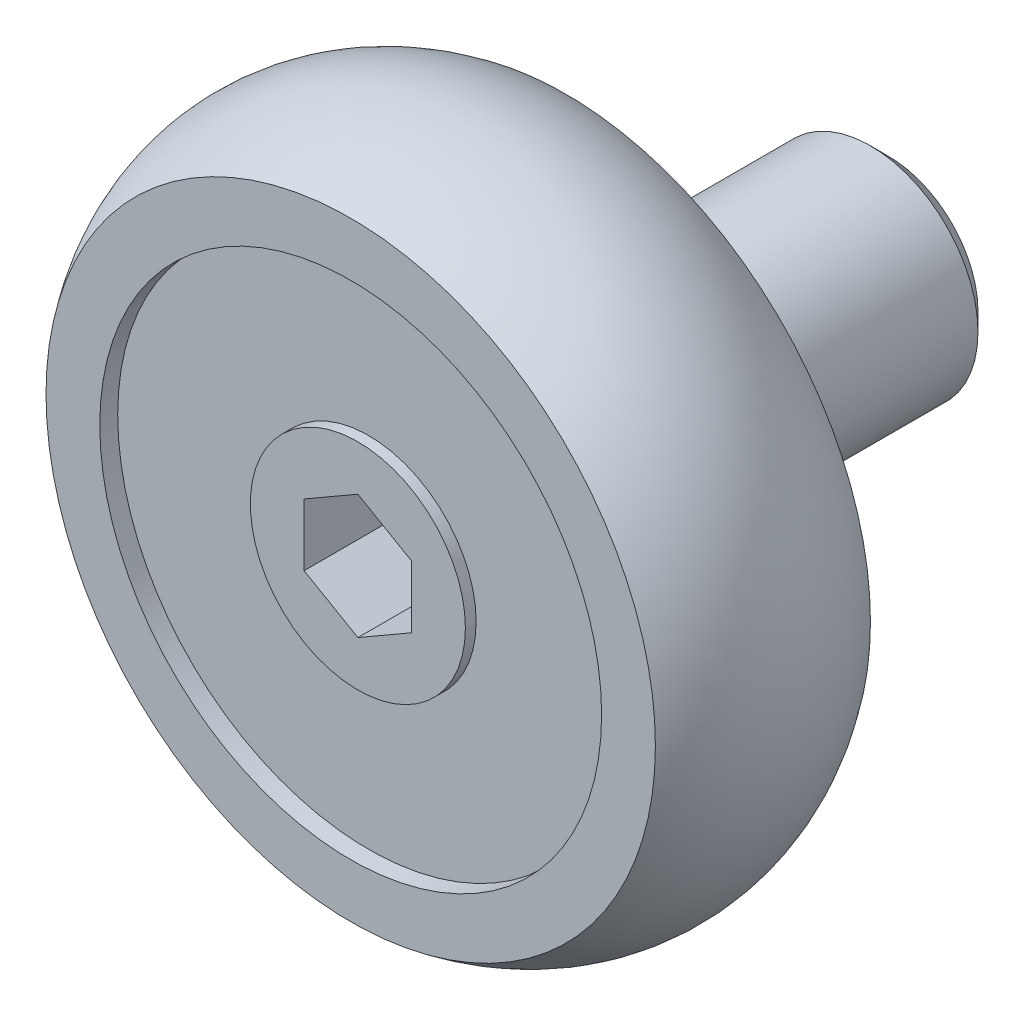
ISO-10303-21;
HEADER;
FILE_DESCRIPTION(('STEP AP214'),'2;1');
FILE_NAME('part.step','',(''),(''),'','','');
FILE_SCHEMA(('AUTOMOTIVE_DESIGN { 1 0 10303 214 1 1 1 1 }'));
ENDSEC;
DATA;
#1=APPLICATION_CONTEXT('core data for automotive mechanical design processes');
#2=APPLICATION_PROTOCOL_DEFINITION('international standard','automotive_design',2000,#1);
#3=PRODUCT_CONTEXT('',#1,'mechanical');
#4=PRODUCT('Part','Part','',(#3));
#5=PRODUCT_RELATED_PRODUCT_CATEGORY('part','',(#4));
#6=PRODUCT_DEFINITION_FORMATION('','',#4);
#7=PRODUCT_DEFINITION_CONTEXT('part definition',#1,'design');
#8=PRODUCT_DEFINITION('design','',#6,#7);
#9=PRODUCT_DEFINITION_SHAPE('','',#8);
#10=(LENGTH_UNIT() NAMED_UNIT(*) SI_UNIT(.MILLI.,.METRE.));
#11=(NAMED_UNIT(*) PLANE_ANGLE_UNIT() SI_UNIT($,.RADIAN.));
#12=(NAMED_UNIT(*) SI_UNIT($,.STERADIAN.) SOLID_ANGLE_UNIT());
#13=UNCERTAINTY_MEASURE_WITH_UNIT(LENGTH_MEASURE(1.E-05),#10,'distance_accuracy_value','');
#14=(GEOMETRIC_REPRESENTATION_CONTEXT(3) GLOBAL_UNCERTAINTY_ASSIGNED_CONTEXT((#13)) GLOBAL_UNIT_ASSIGNED_CONTEXT((#10,
#11,#12)) REPRESENTATION_CONTEXT('',''));
#15=CARTESIAN_POINT('',(0.,0.,0.));
#16=DIRECTION('',(0.,0.,1.));
#17=DIRECTION('',(1.,0.,0.));
#18=AXIS2_PLACEMENT_3D('',#15,#16,#17);
#19=CARTESIAN_POINT('',(0.,0.,-8.));
#20=DIRECTION('',(0.,0.,1.));
#21=DIRECTION('',(1.,0.,0.));
#22=AXIS2_PLACEMENT_3D('',#19,#20,#21);
#23=PLANE('',#22);
#24=CARTESIAN_POINT('',(0.,0.,-8.));
#25=DIRECTION('',(0.,0.,1.));
#26=DIRECTION('',(1.,0.,0.));
#27=AXIS2_PLACEMENT_3D('',#24,#25,#26);
#28=CIRCLE('',#27,2.49999999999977);
#29=CARTESIAN_POINT('',(2.49999999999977,0.,-8.));
#30=VERTEX_POINT('',#29);
#31=EDGE_CURVE('E9',#30,#30,#28,.T.);
#32=ORIENTED_EDGE('',*,*,#31,.F.);
#33=EDGE_LOOP('',(#32));
#34=FACE_BOUND('',#33,.T.);
#35=ADVANCED_FACE('F14',(#34),#23,.F.);
#36=CARTESIAN_POINT('',(0.,0.,-8.));
#37=DIRECTION('',(0.,0.,1.));
#38=DIRECTION('',(1.,0.,0.));
#39=AXIS2_PLACEMENT_3D('',#36,#37,#38);
#40=CONICAL_SURFACE('',#39,2.49999999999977,0.785398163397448);
#41=CARTESIAN_POINT('',(0.,0.,-7.5));
#42=DIRECTION('',(0.,0.,1.));
#43=DIRECTION('',(1.,0.,0.));
#44=AXIS2_PLACEMENT_3D('',#41,#42,#43);
#45=CIRCLE('',#44,2.99999999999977);
#46=CARTESIAN_POINT('',(2.99999999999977,0.,-7.5));
#47=VERTEX_POINT('',#46);
#48=EDGE_CURVE('E21',#47,#47,#45,.T.);
#49=ORIENTED_EDGE('',*,*,#48,.F.);
#50=EDGE_LOOP('',(#49));
#51=FACE_BOUND('',#50,.T.);
#52=ORIENTED_EDGE('',*,*,#31,.T.);
#53=EDGE_LOOP('',(#52));
#54=FACE_BOUND('',#53,.T.);
#55=ADVANCED_FACE('F163',(#51,#54),#40,.T.);
#56=CARTESIAN_POINT('',(0.,0.,10.));
#57=DIRECTION('',(0.,0.,1.));
#58=DIRECTION('',(1.,0.,0.));
#59=AXIS2_PLACEMENT_3D('',#56,#57,#58);
#60=CYLINDRICAL_SURFACE('',#59,2.99999999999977);
#61=CARTESIAN_POINT('',(0.,0.,-2.));
#62=DIRECTION('',(0.,0.,1.));
#63=DIRECTION('',(1.,0.,0.));
#64=AXIS2_PLACEMENT_3D('',#61,#62,#63);
#65=CIRCLE('',#64,2.99999999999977);
#66=CARTESIAN_POINT('',(2.99999999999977,0.,-2.));
#67=VERTEX_POINT('',#66);
#68=EDGE_CURVE('E156',#67,#67,#65,.T.);
#69=ORIENTED_EDGE('',*,*,#68,.F.);
#70=EDGE_LOOP('',(#69));
#71=FACE_BOUND('',#70,.T.);
#72=ORIENTED_EDGE('',*,*,#48,.T.);
#73=EDGE_LOOP('',(#72));
#74=FACE_BOUND('',#73,.T.);
#75=ADVANCED_FACE('F161',(#71,#74),#60,.T.);
#76=CARTESIAN_POINT('',(0.,2.34999999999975,-2.));
#77=DIRECTION('',(0.,0.,-1.));
#78=DIRECTION('',(-1.,0.,0.));
#79=AXIS2_PLACEMENT_3D('',#76,#77,#78);
#80=PLANE('',#79);
#81=CARTESIAN_POINT('',(0.,0.,-2.));
#82=DIRECTION('',(0.,0.,1.));
#83=DIRECTION('',(1.,0.,0.));
#84=AXIS2_PLACEMENT_3D('',#81,#82,#83);
#85=CIRCLE('',#84,2.34999999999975);
#86=CARTESIAN_POINT('',(2.34999999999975,0.,-2.));
#87=VERTEX_POINT('',#86);
#88=EDGE_CURVE('E153',#87,#87,#85,.T.);
#89=ORIENTED_EDGE('',*,*,#88,.F.);
#90=EDGE_LOOP('',(#89));
#91=FACE_BOUND('',#90,.T.);
#92=ORIENTED_EDGE('',*,*,#68,.T.);
#93=EDGE_LOOP('',(#92));
#94=FACE_BOUND('',#93,.T.);
#95=ADVANCED_FACE('F188',(#91,#94),#80,.F.);
#96=CARTESIAN_POINT('',(0.,0.,10.));
#97=DIRECTION('',(0.,0.,1.));
#98=DIRECTION('',(1.,0.,0.));
#99=AXIS2_PLACEMENT_3D('',#96,#97,#98);
#100=CYLINDRICAL_SURFACE('',#99,2.34999999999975);
#101=CARTESIAN_POINT('',(0.,0.,0.));
#102=DIRECTION('',(0.,0.,1.));
#103=DIRECTION('',(1.,0.,0.));
#104=AXIS2_PLACEMENT_3D('',#101,#102,#103);
#105=CIRCLE('',#104,2.34999999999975);
#106=CARTESIAN_POINT('',(2.34999999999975,0.,0.));
#107=VERTEX_POINT('',#106);
#108=EDGE_CURVE('E150',#107,#107,#105,.T.);
#109=ORIENTED_EDGE('',*,*,#108,.F.);
#110=EDGE_LOOP('',(#109));
#111=FACE_BOUND('',#110,.T.);
#112=ORIENTED_EDGE('',*,*,#88,.T.);
#113=EDGE_LOOP('',(#112));
#114=FACE_BOUND('',#113,.T.);
#115=ADVANCED_FACE('F197',(#111,#114),#100,.T.);
#116=CARTESIAN_POINT('',(0.,3.99999999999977,0.));
#117=DIRECTION('',(0.,0.,1.));
#118=DIRECTION('',(1.,0.,0.));
#119=AXIS2_PLACEMENT_3D('',#116,#117,#118);
#120=PLANE('',#119);
#121=CARTESIAN_POINT('',(0.,0.,0.));
#122=DIRECTION('',(0.,0.,1.));
#123=DIRECTION('',(1.,0.,0.));
#124=AXIS2_PLACEMENT_3D('',#121,#122,#123);
#125=CIRCLE('',#124,3.99999999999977);
#126=CARTESIAN_POINT('',(3.99999999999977,0.,0.));
#127=VERTEX_POINT('',#126);
#128=EDGE_CURVE('E147',#127,#127,#125,.T.);
#129=ORIENTED_EDGE('',*,*,#128,.F.);
#130=EDGE_LOOP('',(#129));
#131=FACE_BOUND('',#130,.T.);
#132=ORIENTED_EDGE('',*,*,#108,.T.);
#133=EDGE_LOOP('',(#132));
#134=FACE_BOUND('',#133,.T.);
#135=ADVANCED_FACE('F206',(#131,#134),#120,.F.);
#136=CARTESIAN_POINT('',(0.,0.,10.));
#137=DIRECTION('',(0.,0.,1.));
#138=DIRECTION('',(1.,0.,0.));
#139=AXIS2_PLACEMENT_3D('',#136,#137,#138);
#140=CYLINDRICAL_SURFACE('',#139,3.99999999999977);
#141=CARTESIAN_POINT('',(0.,0.,1.5));
#142=DIRECTION('',(0.,0.,1.));
#143=DIRECTION('',(1.,0.,0.));
#144=AXIS2_PLACEMENT_3D('',#141,#142,#143);
#145=CIRCLE('',#144,3.99999999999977);
#146=CARTESIAN_POINT('',(3.99999999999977,0.,1.5));
#147=VERTEX_POINT('',#146);
#148=EDGE_CURVE('E144',#147,#147,#145,.T.);
#149=ORIENTED_EDGE('',*,*,#148,.F.);
#150=EDGE_LOOP('',(#149));
#151=FACE_BOUND('',#150,.T.);
#152=ORIENTED_EDGE('',*,*,#128,.T.);
#153=EDGE_LOOP('',(#152));
#154=FACE_BOUND('',#153,.T.);
#155=ADVANCED_FACE('F215',(#151,#154),#140,.T.);
#156=CARTESIAN_POINT('',(0.,3.99999999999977,1.5));
#157=DIRECTION('',(0.,0.,1.));
#158=DIRECTION('',(1.,0.,0.));
#159=AXIS2_PLACEMENT_3D('',#156,#157,#158);
#160=PLANE('',#159);
#161=CARTESIAN_POINT('',(0.,0.,1.5));
#162=DIRECTION('',(0.,0.,1.));
#163=DIRECTION('',(1.,0.,0.));
#164=AXIS2_PLACEMENT_3D('',#161,#162,#163);
#165=CIRCLE('',#164,7.);
#166=CARTESIAN_POINT('',(7.,0.,1.5));
#167=VERTEX_POINT('',#166);
#168=EDGE_CURVE('E141',#167,#167,#165,.T.);
#169=ORIENTED_EDGE('',*,*,#168,.F.);
#170=EDGE_LOOP('',(#169));
#171=FACE_BOUND('',#170,.T.);
#172=ORIENTED_EDGE('',*,*,#148,.T.);
#173=EDGE_LOOP('',(#172));
#174=FACE_BOUND('',#173,.T.);
#175=ADVANCED_FACE('F224',(#171,#174),#160,.F.);
#176=CARTESIAN_POINT('',(0.,0.,10.));
#177=DIRECTION('',(0.,0.,1.));
#178=DIRECTION('',(1.,0.,0.));
#179=AXIS2_PLACEMENT_3D('',#176,#177,#178);
#180=CYLINDRICAL_SURFACE('',#179,7.);
#181=CARTESIAN_POINT('',(0.,0.,1.));
#182=DIRECTION('',(0.,0.,1.));
#183=DIRECTION('',(1.,0.,0.));
#184=AXIS2_PLACEMENT_3D('',#181,#182,#183);
#185=CIRCLE('',#184,7.);
#186=CARTESIAN_POINT('',(7.,0.,1.));
#187=VERTEX_POINT('',#186);
#188=EDGE_CURVE('E138',#187,#187,#185,.T.);
#189=ORIENTED_EDGE('',*,*,#188,.F.);
#190=EDGE_LOOP('',(#189));
#191=FACE_BOUND('',#190,.T.);
#192=ORIENTED_EDGE('',*,*,#168,.T.);
#193=EDGE_LOOP('',(#192));
#194=FACE_BOUND('',#193,.T.);
#195=ADVANCED_FACE('F233',(#191,#194),#180,.F.);
#196=CARTESIAN_POINT('',(0.,8.5,1.));
#197=DIRECTION('',(0.,0.,1.));
#198=DIRECTION('',(1.,0.,0.));
#199=AXIS2_PLACEMENT_3D('',#196,#197,#198);
#200=PLANE('',#199);
#201=CARTESIAN_POINT('',(0.,0.,1.));
#202=DIRECTION('',(0.,0.,1.));
#203=DIRECTION('',(1.,0.,0.));
#204=AXIS2_PLACEMENT_3D('',#201,#202,#203);
#205=CIRCLE('',#204,8.5);
#206=CARTESIAN_POINT('',(8.5,0.,1.));
#207=VERTEX_POINT('',#206);
#208=EDGE_CURVE('E135',#207,#207,#205,.T.);
#209=ORIENTED_EDGE('',*,*,#208,.F.);
#210=EDGE_LOOP('',(#209));
#211=FACE_BOUND('',#210,.T.);
#212=ORIENTED_EDGE('',*,*,#188,.T.);
#213=EDGE_LOOP('',(#212));
#214=FACE_BOUND('',#213,.T.);
#215=ADVANCED_FACE('F242',(#211,#214),#200,.F.);
#216=CARTESIAN_POINT('',(0.,0.,4.));
#217=DIRECTION('',(0.,0.,1.));
#218=DIRECTION('',(1.,0.,0.));
#219=AXIS2_PLACEMENT_3D('',#216,#217,#218);
#220=DEGENERATE_TOROIDAL_SURFACE('',#219,4.5,5.,.T.);
#221=CARTESIAN_POINT('',(0.,0.,7.));
#222=DIRECTION('',(0.,0.,1.));
#223=DIRECTION('',(1.,0.,0.));
#224=AXIS2_PLACEMENT_3D('',#221,#222,#223);
#225=CIRCLE('',#224,8.5);
#226=CARTESIAN_POINT('',(8.5,0.,7.));
#227=VERTEX_POINT('',#226);
#228=EDGE_CURVE('E132',#227,#227,#225,.T.);
#229=ORIENTED_EDGE('',*,*,#228,.F.);
#230=EDGE_LOOP('',(#229));
#231=FACE_BOUND('',#230,.T.);
#232=ORIENTED_EDGE('',*,*,#208,.T.);
#233=EDGE_LOOP('',(#232));
#234=FACE_BOUND('',#233,.T.);
#235=ADVANCED_FACE('F251',(#231,#234),#220,.T.);
#236=CARTESIAN_POINT('',(0.,8.5,7.));
#237=DIRECTION('',(0.,0.,-1.));
#238=DIRECTION('',(-1.,0.,0.));
#239=AXIS2_PLACEMENT_3D('',#236,#237,#238);
#240=PLANE('',#239);
#241=CARTESIAN_POINT('',(0.,0.,7.));
#242=DIRECTION('',(0.,0.,1.));
#243=DIRECTION('',(1.,0.,0.));
#244=AXIS2_PLACEMENT_3D('',#241,#242,#243);
#245=CIRCLE('',#244,7.);
#246=CARTESIAN_POINT('',(7.,0.,7.));
#247=VERTEX_POINT('',#246);
#248=EDGE_CURVE('E129',#247,#247,#245,.T.);
#249=ORIENTED_EDGE('',*,*,#248,.F.);
#250=EDGE_LOOP('',(#249));
#251=FACE_BOUND('',#250,.T.);
#252=ORIENTED_EDGE('',*,*,#228,.T.);
#253=EDGE_LOOP('',(#252));
#254=FACE_BOUND('',#253,.T.);
#255=ADVANCED_FACE('F260',(#251,#254),#240,.F.);
#256=CARTESIAN_POINT('',(0.,0.,10.));
#257=DIRECTION('',(0.,0.,1.));
#258=DIRECTION('',(1.,0.,0.));
#259=AXIS2_PLACEMENT_3D('',#256,#257,#258);
#260=CYLINDRICAL_SURFACE('',#259,7.);
#261=CARTESIAN_POINT('',(0.,0.,6.5));
#262=DIRECTION('',(0.,0.,1.));
#263=DIRECTION('',(1.,0.,0.));
#264=AXIS2_PLACEMENT_3D('',#261,#262,#263);
#265=CIRCLE('',#264,7.);
#266=CARTESIAN_POINT('',(7.,0.,6.5));
#267=VERTEX_POINT('',#266);
#268=EDGE_CURVE('E126',#267,#267,#265,.T.);
#269=ORIENTED_EDGE('',*,*,#268,.F.);
#270=EDGE_LOOP('',(#269));
#271=FACE_BOUND('',#270,.T.);
#272=ORIENTED_EDGE('',*,*,#248,.T.);
#273=EDGE_LOOP('',(#272));
#274=FACE_BOUND('',#273,.T.);
#275=ADVANCED_FACE('F269',(#271,#274),#260,.F.);
#276=CARTESIAN_POINT('',(0.,3.,6.5));
#277=DIRECTION('',(0.,0.,-1.));
#278=DIRECTION('',(-1.,0.,0.));
#279=AXIS2_PLACEMENT_3D('',#276,#277,#278);
#280=PLANE('',#279);
#281=CARTESIAN_POINT('',(0.,0.,6.5));
#282=DIRECTION('',(0.,0.,1.));
#283=DIRECTION('',(1.,0.,0.));
#284=AXIS2_PLACEMENT_3D('',#281,#282,#283);
#285=CIRCLE('',#284,3.);
#286=CARTESIAN_POINT('',(3.,0.,6.5));
#287=VERTEX_POINT('',#286);
#288=EDGE_CURVE('E123',#287,#287,#285,.T.);
#289=ORIENTED_EDGE('',*,*,#288,.F.);
#290=EDGE_LOOP('',(#289));
#291=FACE_BOUND('',#290,.T.);
#292=ORIENTED_EDGE('',*,*,#268,.T.);
#293=EDGE_LOOP('',(#292));
#294=FACE_BOUND('',#293,.T.);
#295=ADVANCED_FACE('F278',(#291,#294),#280,.F.);
#296=CARTESIAN_POINT('',(0.,0.,10.));
#297=DIRECTION('',(0.,0.,1.));
#298=DIRECTION('',(1.,0.,0.));
#299=AXIS2_PLACEMENT_3D('',#296,#297,#298);
#300=CYLINDRICAL_SURFACE('',#299,3.);
#301=CARTESIAN_POINT('',(0.,0.,6.8));
#302=DIRECTION('',(0.,0.,1.));
#303=DIRECTION('',(1.,0.,0.));
#304=AXIS2_PLACEMENT_3D('',#301,#302,#303);
#305=CIRCLE('',#304,3.);
#306=CARTESIAN_POINT('',(3.,0.,6.8));
#307=VERTEX_POINT('',#306);
#308=EDGE_CURVE('E115',#307,#307,#305,.T.);
#309=ORIENTED_EDGE('',*,*,#308,.F.);
#310=EDGE_LOOP('',(#309));
#311=FACE_BOUND('',#310,.T.);
#312=ORIENTED_EDGE('',*,*,#288,.T.);
#313=EDGE_LOOP('',(#312));
#314=FACE_BOUND('',#313,.T.);
#315=ADVANCED_FACE('F287',(#311,#314),#300,.T.);
#316=CARTESIAN_POINT('',(0.,3.,6.8));
#317=DIRECTION('',(0.,0.,-1.));
#318=DIRECTION('',(-1.,0.,0.));
#319=AXIS2_PLACEMENT_3D('',#316,#317,#318);
#320=PLANE('',#319);
#321=DIRECTION('',(-0.866025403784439,-0.5,0.));
#322=VECTOR('',#321,1.);
#323=CARTESIAN_POINT('',(0.,1.73205080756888,6.8));
#324=LINE('',#323,#322);
#325=CARTESIAN_POINT('',(0.,1.73205080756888,6.8));
#326=VERTEX_POINT('',#325);
#327=CARTESIAN_POINT('',(-1.5,0.866025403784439,6.8));
#328=VERTEX_POINT('',#327);
#329=EDGE_CURVE('E102',#326,#328,#324,.T.);
#330=ORIENTED_EDGE('',*,*,#329,.F.);
#331=DIRECTION('',(-0.866025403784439,0.5,0.));
#332=VECTOR('',#331,1.);
#333=CARTESIAN_POINT('',(1.5,0.86602540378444,6.8));
#334=LINE('',#333,#332);
#335=CARTESIAN_POINT('',(1.5,0.86602540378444,6.8));
#336=VERTEX_POINT('',#335);
#337=EDGE_CURVE('E28',#336,#326,#334,.T.);
#338=ORIENTED_EDGE('',*,*,#337,.F.);
#339=DIRECTION('',(0.,1.,0.));
#340=VECTOR('',#339,1.);
#341=CARTESIAN_POINT('',(1.5,-0.866025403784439,6.8));
#342=LINE('',#341,#340);
#343=CARTESIAN_POINT('',(1.5,-0.866025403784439,6.8));
#344=VERTEX_POINT('',#343);
#345=EDGE_CURVE('E111',#344,#336,#342,.T.);
#346=ORIENTED_EDGE('',*,*,#345,.F.);
#347=DIRECTION('',(0.866025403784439,0.5,0.));
#348=VECTOR('',#347,1.);
#349=CARTESIAN_POINT('',(0.,-1.73205080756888,6.8));
#350=LINE('',#349,#348);
#351=CARTESIAN_POINT('',(0.,-1.73205080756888,6.8));
#352=VERTEX_POINT('',#351);
#353=EDGE_CURVE('E109',#352,#344,#350,.T.);
#354=ORIENTED_EDGE('',*,*,#353,.F.);
#355=DIRECTION('',(0.866025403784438,-0.5,0.));
#356=VECTOR('',#355,1.);
#357=CARTESIAN_POINT('',(-1.5,-0.866025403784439,6.8));
#358=LINE('',#357,#356);
#359=CARTESIAN_POINT('',(-1.5,-0.866025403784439,6.8));
#360=VERTEX_POINT('',#359);
#361=EDGE_CURVE('E76',#360,#352,#358,.T.);
#362=ORIENTED_EDGE('',*,*,#361,.F.);
#363=DIRECTION('',(0.,-1.,0.));
#364=VECTOR('',#363,1.);
#365=CARTESIAN_POINT('',(-1.5,0.866025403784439,6.8));
#366=LINE('',#365,#364);
#367=EDGE_CURVE('E105',#328,#360,#366,.T.);
#368=ORIENTED_EDGE('',*,*,#367,.F.);
#369=EDGE_LOOP('',(#330,#338,#346,#354,#362,#368));
#370=FACE_BOUND('',#369,.T.);
#371=ORIENTED_EDGE('',*,*,#308,.T.);
#372=EDGE_LOOP('',(#371));
#373=FACE_BOUND('',#372,.T.);
#374=ADVANCED_FACE('F296',(#370,#373),#320,.F.);
#375=CARTESIAN_POINT('',(1.5,0.86602540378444,4.3));
#376=DIRECTION('',(0.5,0.866025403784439,0.));
#377=DIRECTION('',(-0.866025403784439,0.5,0.));
#378=AXIS2_PLACEMENT_3D('',#375,#376,#377);
#379=PLANE('',#378);
#380=ORIENTED_EDGE('',*,*,#337,.T.);
#381=DIRECTION('',(0.,0.,1.));
#382=VECTOR('',#381,1.);
#383=CARTESIAN_POINT('',(0.,1.73205080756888,4.3));
#384=LINE('',#383,#382);
#385=CARTESIAN_POINT('',(0.,1.73205080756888,4.3));
#386=VERTEX_POINT('',#385);
#387=EDGE_CURVE('E58',#386,#326,#384,.T.);
#388=ORIENTED_EDGE('',*,*,#387,.F.);
#389=DIRECTION('',(-0.866025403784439,0.5,0.));
#390=VECTOR('',#389,1.);
#391=CARTESIAN_POINT('',(1.5,0.86602540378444,4.3));
#392=LINE('',#391,#390);
#393=CARTESIAN_POINT('',(1.5,0.86602540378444,4.3));
#394=VERTEX_POINT('',#393);
#395=EDGE_CURVE('E113',#394,#386,#392,.T.);
#396=ORIENTED_EDGE('',*,*,#395,.F.);
#397=DIRECTION('',(0.,0.,1.));
#398=VECTOR('',#397,1.);
#399=CARTESIAN_POINT('',(1.5,0.86602540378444,4.3));
#400=LINE('',#399,#398);
#401=EDGE_CURVE('E36',#394,#336,#400,.T.);
#402=ORIENTED_EDGE('',*,*,#401,.T.);
#403=EDGE_LOOP('',(#380,#388,#396,#402));
#404=FACE_BOUND('',#403,.T.);
#405=ADVANCED_FACE('F305',(#404),#379,.F.);
#406=CARTESIAN_POINT('',(1.5,-0.866025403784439,4.3));
#407=DIRECTION('',(1.,0.,0.));
#408=DIRECTION('',(0.,0.,-1.));
#409=AXIS2_PLACEMENT_3D('',#406,#407,#408);
#410=PLANE('',#409);
#411=ORIENTED_EDGE('',*,*,#345,.T.);
#412=ORIENTED_EDGE('',*,*,#401,.F.);
#413=DIRECTION('',(0.,1.,0.));
#414=VECTOR('',#413,1.);
#415=CARTESIAN_POINT('',(1.5,-0.866025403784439,4.3));
#416=LINE('',#415,#414);
#417=CARTESIAN_POINT('',(1.5,-0.866025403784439,4.3));
#418=VERTEX_POINT('',#417);
#419=EDGE_CURVE('E88',#418,#394,#416,.T.);
#420=ORIENTED_EDGE('',*,*,#419,.F.);
#421=DIRECTION('',(0.,0.,1.));
#422=VECTOR('',#421,1.);
#423=CARTESIAN_POINT('',(1.5,-0.866025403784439,4.3));
#424=LINE('',#423,#422);
#425=EDGE_CURVE('E80',#418,#344,#424,.T.);
#426=ORIENTED_EDGE('',*,*,#425,.T.);
#427=EDGE_LOOP('',(#411,#412,#420,#426));
#428=FACE_BOUND('',#427,.T.);
#429=ADVANCED_FACE('F314',(#428),#410,.F.);
#430=CARTESIAN_POINT('',(0.,-1.73205080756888,4.3));
#431=DIRECTION('',(0.5,-0.866025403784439,0.));
#432=DIRECTION('',(0.866025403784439,0.5,0.));
#433=AXIS2_PLACEMENT_3D('',#430,#431,#432);
#434=PLANE('',#433);
#435=ORIENTED_EDGE('',*,*,#353,.T.);
#436=ORIENTED_EDGE('',*,*,#425,.F.);
#437=DIRECTION('',(0.866025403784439,0.5,0.));
#438=VECTOR('',#437,1.);
#439=CARTESIAN_POINT('',(0.,-1.73205080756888,4.3));
#440=LINE('',#439,#438);
#441=CARTESIAN_POINT('',(0.,-1.73205080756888,4.3));
#442=VERTEX_POINT('',#441);
#443=EDGE_CURVE('E84',#442,#418,#440,.T.);
#444=ORIENTED_EDGE('',*,*,#443,.F.);
#445=DIRECTION('',(0.,0.,1.));
#446=VECTOR('',#445,1.);
#447=CARTESIAN_POINT('',(0.,-1.73205080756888,4.3));
#448=LINE('',#447,#446);
#449=EDGE_CURVE('E69',#442,#352,#448,.T.);
#450=ORIENTED_EDGE('',*,*,#449,.T.);
#451=EDGE_LOOP('',(#435,#436,#444,#450));
#452=FACE_BOUND('',#451,.T.);
#453=ADVANCED_FACE('F85',(#452),#434,.F.);
#454=CARTESIAN_POINT('',(-1.5,-0.866025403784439,4.3));
#455=DIRECTION('',(-0.5,-0.866025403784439,0.));
#456=DIRECTION('',(0.866025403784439,-0.5,0.));
#457=AXIS2_PLACEMENT_3D('',#454,#455,#456);
#458=PLANE('',#457);
#459=ORIENTED_EDGE('',*,*,#361,.T.);
#460=ORIENTED_EDGE('',*,*,#449,.F.);
#461=DIRECTION('',(0.866025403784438,-0.5,0.));
#462=VECTOR('',#461,1.);
#463=CARTESIAN_POINT('',(-1.5,-0.866025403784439,4.3));
#464=LINE('',#463,#462);
#465=CARTESIAN_POINT('',(-1.5,-0.866025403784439,4.3));
#466=VERTEX_POINT('',#465);
#467=EDGE_CURVE('E73',#466,#442,#464,.T.);
#468=ORIENTED_EDGE('',*,*,#467,.F.);
#469=DIRECTION('',(0.,0.,1.));
#470=VECTOR('',#469,1.);
#471=CARTESIAN_POINT('',(-1.5,-0.866025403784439,4.3));
#472=LINE('',#471,#470);
#473=EDGE_CURVE('E81',#466,#360,#472,.T.);
#474=ORIENTED_EDGE('',*,*,#473,.T.);
#475=EDGE_LOOP('',(#459,#460,#468,#474));
#476=FACE_BOUND('',#475,.T.);
#477=ADVANCED_FACE('F71',(#476),#458,.F.);
#478=CARTESIAN_POINT('',(-1.5,0.866025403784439,4.3));
#479=DIRECTION('',(-1.,0.,0.));
#480=DIRECTION('',(0.,-1.,0.));
#481=AXIS2_PLACEMENT_3D('',#478,#479,#480);
#482=PLANE('',#481);
#483=ORIENTED_EDGE('',*,*,#367,.T.);
#484=ORIENTED_EDGE('',*,*,#473,.F.);
#485=DIRECTION('',(0.,-1.,0.));
#486=VECTOR('',#485,1.);
#487=CARTESIAN_POINT('',(-1.5,0.866025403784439,4.3));
#488=LINE('',#487,#486);
#489=CARTESIAN_POINT('',(-1.5,0.866025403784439,4.3));
#490=VERTEX_POINT('',#489);
#491=EDGE_CURVE('E94',#490,#466,#488,.T.);
#492=ORIENTED_EDGE('',*,*,#491,.F.);
#493=DIRECTION('',(0.,0.,1.));
#494=VECTOR('',#493,1.);
#495=CARTESIAN_POINT('',(-1.5,0.866025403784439,4.3));
#496=LINE('',#495,#494);
#497=EDGE_CURVE('E118',#490,#328,#496,.T.);
#498=ORIENTED_EDGE('',*,*,#497,.T.);
#499=EDGE_LOOP('',(#483,#484,#492,#498));
#500=FACE_BOUND('',#499,.T.);
#501=ADVANCED_FACE('F336',(#500),#482,.F.);
#502=CARTESIAN_POINT('',(0.,1.73205080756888,4.3));
#503=DIRECTION('',(-0.5,0.866025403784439,0.));
#504=DIRECTION('',(-0.866025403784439,-0.5,0.));
#505=AXIS2_PLACEMENT_3D('',#502,#503,#504);
#506=PLANE('',#505);
#507=ORIENTED_EDGE('',*,*,#329,.T.);
#508=ORIENTED_EDGE('',*,*,#497,.F.);
#509=DIRECTION('',(-0.866025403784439,-0.5,0.));
#510=VECTOR('',#509,1.);
#511=CARTESIAN_POINT('',(0.,1.73205080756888,4.3));
#512=LINE('',#511,#510);
#513=EDGE_CURVE('E96',#386,#490,#512,.T.);
#514=ORIENTED_EDGE('',*,*,#513,.F.);
#515=ORIENTED_EDGE('',*,*,#387,.T.);
#516=EDGE_LOOP('',(#507,#508,#514,#515));
#517=FACE_BOUND('',#516,.T.);
#518=ADVANCED_FACE('F344',(#517),#506,.F.);
#519=CARTESIAN_POINT('',(0.,0.,4.3));
#520=DIRECTION('',(0.,0.,1.));
#521=DIRECTION('',(1.,0.,0.));
#522=AXIS2_PLACEMENT_3D('',#519,#520,#521);
#523=PLANE('',#522);
#524=ORIENTED_EDGE('',*,*,#395,.T.);
#525=ORIENTED_EDGE('',*,*,#513,.T.);
#526=ORIENTED_EDGE('',*,*,#491,.T.);
#527=ORIENTED_EDGE('',*,*,#467,.T.);
#528=ORIENTED_EDGE('',*,*,#443,.T.);
#529=ORIENTED_EDGE('',*,*,#419,.T.);
#530=EDGE_LOOP('',(#524,#525,#526,#527,#528,#529));
#531=FACE_BOUND('',#530,.T.);
#532=ADVANCED_FACE('F91',(#531),#523,.T.);
#533=CLOSED_SHELL('',(#35,#55,#75,#95,#115,#135,#155,#175,#195,#215,#235,#255,#275,#295,#315,
#374,#405,#429,#453,#477,#501,#518,#532));
#534=MANIFOLD_SOLID_BREP('B1',#533);
#535=ADVANCED_BREP_SHAPE_REPRESENTATION('',(#18,#534),#14);
#536=SHAPE_DEFINITION_REPRESENTATION(#9,#535);
ENDSEC;
END-ISO-10303-21;
